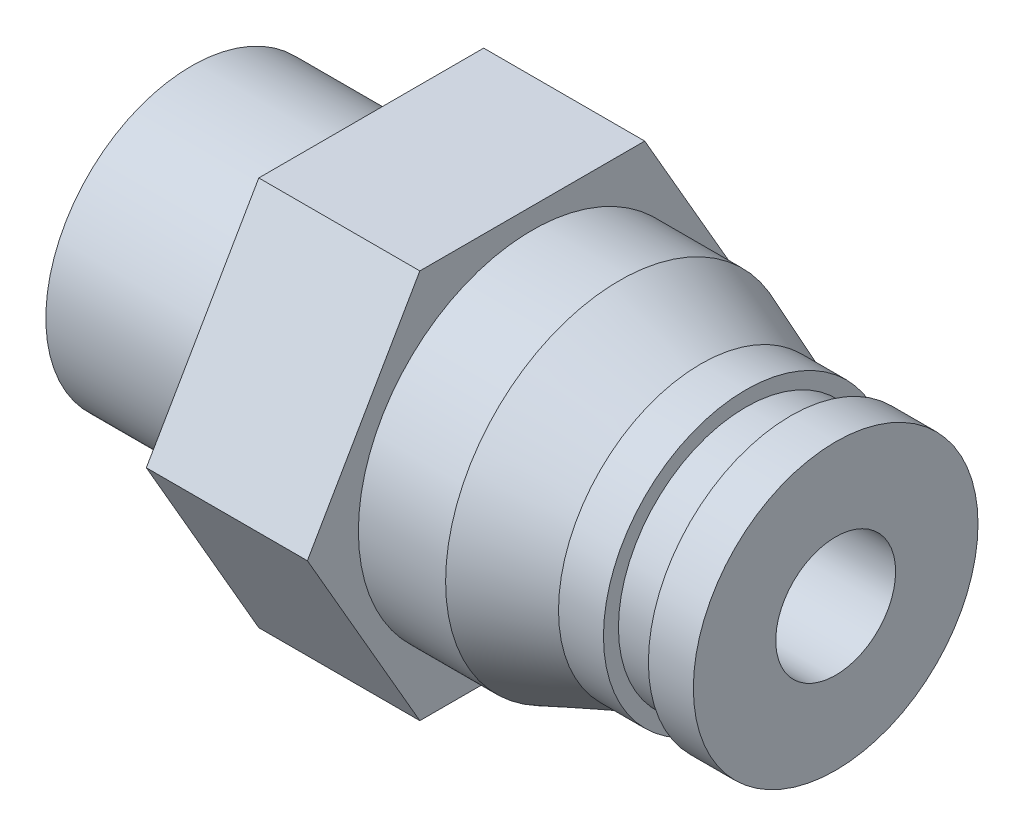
ISO-10303-21;
HEADER;
FILE_DESCRIPTION(('STEP AP214'),'2;1');
FILE_NAME('part.step','',(''),(''),'','','');
FILE_SCHEMA(('AUTOMOTIVE_DESIGN { 1 0 10303 214 1 1 1 1 }'));
ENDSEC;
DATA;
#1=APPLICATION_CONTEXT('core data for automotive mechanical design processes');
#2=APPLICATION_PROTOCOL_DEFINITION('international standard','automotive_design',2000,#1);
#3=PRODUCT_CONTEXT('',#1,'mechanical');
#4=PRODUCT('Part','Part','',(#3));
#5=PRODUCT_RELATED_PRODUCT_CATEGORY('part','',(#4));
#6=PRODUCT_DEFINITION_FORMATION('','',#4);
#7=PRODUCT_DEFINITION_CONTEXT('part definition',#1,'design');
#8=PRODUCT_DEFINITION('design','',#6,#7);
#9=PRODUCT_DEFINITION_SHAPE('','',#8);
#10=(LENGTH_UNIT() NAMED_UNIT(*) SI_UNIT(.MILLI.,.METRE.));
#11=(NAMED_UNIT(*) PLANE_ANGLE_UNIT() SI_UNIT($,.RADIAN.));
#12=(NAMED_UNIT(*) SI_UNIT($,.STERADIAN.) SOLID_ANGLE_UNIT());
#13=UNCERTAINTY_MEASURE_WITH_UNIT(LENGTH_MEASURE(1.E-05),#10,'distance_accuracy_value','');
#14=(GEOMETRIC_REPRESENTATION_CONTEXT(3) GLOBAL_UNCERTAINTY_ASSIGNED_CONTEXT((#13)) GLOBAL_UNIT_ASSIGNED_CONTEXT((#10,
#11,#12)) REPRESENTATION_CONTEXT('',''));
#15=CARTESIAN_POINT('',(0.,0.,0.));
#16=DIRECTION('',(0.,0.,1.));
#17=DIRECTION('',(1.,0.,0.));
#18=AXIS2_PLACEMENT_3D('',#15,#16,#17);
#19=CARTESIAN_POINT('',(6.,4.86,0.));
#20=DIRECTION('',(-1.,0.,0.));
#21=DIRECTION('',(0.,0.,1.));
#22=AXIS2_PLACEMENT_3D('',#19,#20,#21);
#23=PLANE('',#22);
#24=CARTESIAN_POINT('',(6.,0.,0.));
#25=DIRECTION('',(1.,0.,0.));
#26=DIRECTION('',(0.,0.,-1.));
#27=AXIS2_PLACEMENT_3D('',#24,#25,#26);
#28=CIRCLE('',#27,4.86);
#29=CARTESIAN_POINT('',(6.,0.,-4.86));
#30=VERTEX_POINT('',#29);
#31=EDGE_CURVE('E214',#30,#30,#28,.T.);
#32=ORIENTED_EDGE('',*,*,#31,.T.);
#33=EDGE_LOOP('',(#32));
#34=FACE_BOUND('',#33,.T.);
#35=DIRECTION('',(0.,-0.866025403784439,0.5));
#36=VECTOR('',#35,1.);
#37=CARTESIAN_POINT('',(6.,0.,-7.50555349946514));
#38=LINE('',#37,#36);
#39=CARTESIAN_POINT('',(6.,0.,-7.50555349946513));
#40=VERTEX_POINT('',#39);
#41=CARTESIAN_POINT('',(6.,-6.5,-3.75277674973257));
#42=VERTEX_POINT('',#41);
#43=EDGE_CURVE('E120',#40,#42,#38,.T.);
#44=ORIENTED_EDGE('',*,*,#43,.T.);
#45=DIRECTION('',(0.,0.,1.));
#46=VECTOR('',#45,1.);
#47=CARTESIAN_POINT('',(6.,-6.5,-3.75277674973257));
#48=LINE('',#47,#46);
#49=CARTESIAN_POINT('',(6.,-6.5,3.75277674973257));
#50=VERTEX_POINT('',#49);
#51=EDGE_CURVE('E105',#42,#50,#48,.T.);
#52=ORIENTED_EDGE('',*,*,#51,.T.);
#53=DIRECTION('',(0.,0.866025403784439,0.5));
#54=VECTOR('',#53,1.);
#55=CARTESIAN_POINT('',(6.,-6.5,3.75277674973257));
#56=LINE('',#55,#54);
#57=CARTESIAN_POINT('',(6.,0.,7.50555349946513));
#58=VERTEX_POINT('',#57);
#59=EDGE_CURVE('E114',#50,#58,#56,.T.);
#60=ORIENTED_EDGE('',*,*,#59,.T.);
#61=DIRECTION('',(0.,0.866025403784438,-0.5));
#62=VECTOR('',#61,1.);
#63=CARTESIAN_POINT('',(6.,0.,7.50555349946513));
#64=LINE('',#63,#62);
#65=CARTESIAN_POINT('',(6.,6.5,3.75277674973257));
#66=VERTEX_POINT('',#65);
#67=EDGE_CURVE('E29',#58,#66,#64,.T.);
#68=ORIENTED_EDGE('',*,*,#67,.T.);
#69=DIRECTION('',(0.,0.,-1.));
#70=VECTOR('',#69,1.);
#71=CARTESIAN_POINT('',(6.,6.5,3.75277674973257));
#72=LINE('',#71,#70);
#73=CARTESIAN_POINT('',(6.,6.5,-3.75277674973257));
#74=VERTEX_POINT('',#73);
#75=EDGE_CURVE('E124',#66,#74,#72,.T.);
#76=ORIENTED_EDGE('',*,*,#75,.T.);
#77=DIRECTION('',(0.,-0.866025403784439,-0.5));
#78=VECTOR('',#77,1.);
#79=CARTESIAN_POINT('',(6.,6.5,-3.75277674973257));
#80=LINE('',#79,#78);
#81=EDGE_CURVE('E127',#74,#40,#80,.T.);
#82=ORIENTED_EDGE('',*,*,#81,.T.);
#83=EDGE_LOOP('',(#44,#52,#60,#68,#76,#82));
#84=FACE_BOUND('',#83,.T.);
#85=ADVANCED_FACE('F14',(#34,#84),#23,.T.);
#86=CARTESIAN_POINT('',(11.375,8.5,0.));
#87=DIRECTION('',(1.,0.,0.));
#88=DIRECTION('',(0.,0.,-1.));
#89=AXIS2_PLACEMENT_3D('',#86,#87,#88);
#90=PLANE('',#89);
#91=CARTESIAN_POINT('',(11.375,0.,0.));
#92=DIRECTION('',(1.,0.,0.));
#93=DIRECTION('',(0.,0.,-1.));
#94=AXIS2_PLACEMENT_3D('',#91,#92,#93);
#95=CIRCLE('',#94,5.80412866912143);
#96=CARTESIAN_POINT('',(11.375,0.,-5.80412866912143));
#97=VERTEX_POINT('',#96);
#98=EDGE_CURVE('E211',#97,#97,#95,.T.);
#99=ORIENTED_EDGE('',*,*,#98,.F.);
#100=EDGE_LOOP('',(#99));
#101=FACE_BOUND('',#100,.T.);
#102=DIRECTION('',(0.,0.866025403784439,0.5));
#103=VECTOR('',#102,1.);
#104=CARTESIAN_POINT('',(11.375,-6.5,3.75277674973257));
#105=LINE('',#104,#103);
#106=CARTESIAN_POINT('',(11.375,-6.5,3.75277674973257));
#107=VERTEX_POINT('',#106);
#108=CARTESIAN_POINT('',(11.375,0.,7.50555349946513));
#109=VERTEX_POINT('',#108);
#110=EDGE_CURVE('E131',#107,#109,#105,.T.);
#111=ORIENTED_EDGE('',*,*,#110,.F.);
#112=DIRECTION('',(0.,0.,1.));
#113=VECTOR('',#112,1.);
#114=CARTESIAN_POINT('',(11.375,-6.5,-3.75277674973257));
#115=LINE('',#114,#113);
#116=CARTESIAN_POINT('',(11.375,-6.5,-3.75277674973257));
#117=VERTEX_POINT('',#116);
#118=EDGE_CURVE('E37',#117,#107,#115,.T.);
#119=ORIENTED_EDGE('',*,*,#118,.F.);
#120=DIRECTION('',(0.,-0.866025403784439,0.5));
#121=VECTOR('',#120,1.);
#122=CARTESIAN_POINT('',(11.375,0.,-7.50555349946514));
#123=LINE('',#122,#121);
#124=CARTESIAN_POINT('',(11.375,0.,-7.50555349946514));
#125=VERTEX_POINT('',#124);
#126=EDGE_CURVE('E111',#125,#117,#123,.T.);
#127=ORIENTED_EDGE('',*,*,#126,.F.);
#128=DIRECTION('',(0.,-0.866025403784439,-0.5));
#129=VECTOR('',#128,1.);
#130=CARTESIAN_POINT('',(11.375,6.5,-3.75277674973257));
#131=LINE('',#130,#129);
#132=CARTESIAN_POINT('',(11.375,6.5,-3.75277674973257));
#133=VERTEX_POINT('',#132);
#134=EDGE_CURVE('E139',#133,#125,#131,.T.);
#135=ORIENTED_EDGE('',*,*,#134,.F.);
#136=DIRECTION('',(0.,0.,-1.));
#137=VECTOR('',#136,1.);
#138=CARTESIAN_POINT('',(11.375,6.5,3.75277674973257));
#139=LINE('',#138,#137);
#140=CARTESIAN_POINT('',(11.375,6.5,3.75277674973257));
#141=VERTEX_POINT('',#140);
#142=EDGE_CURVE('E136',#141,#133,#139,.T.);
#143=ORIENTED_EDGE('',*,*,#142,.F.);
#144=DIRECTION('',(0.,0.866025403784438,-0.5));
#145=VECTOR('',#144,1.);
#146=CARTESIAN_POINT('',(11.375,0.,7.50555349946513));
#147=LINE('',#146,#145);
#148=EDGE_CURVE('E133',#109,#141,#147,.T.);
#149=ORIENTED_EDGE('',*,*,#148,.F.);
#150=EDGE_LOOP('',(#111,#119,#127,#135,#143,#149));
#151=FACE_BOUND('',#150,.T.);
#152=ADVANCED_FACE('F268',(#101,#151),#90,.T.);
#153=CARTESIAN_POINT('',(0.,0.,0.));
#154=DIRECTION('',(-1.,0.,0.));
#155=DIRECTION('',(0.,0.,1.));
#156=AXIS2_PLACEMENT_3D('',#153,#154,#155);
#157=PLANE('',#156);
#158=CARTESIAN_POINT('',(0.,0.,0.));
#159=DIRECTION('',(1.,0.,0.));
#160=DIRECTION('',(0.,0.,-1.));
#161=AXIS2_PLACEMENT_3D('',#158,#159,#160);
#162=CIRCLE('',#161,4.86);
#163=CARTESIAN_POINT('',(0.,0.,-4.86));
#164=VERTEX_POINT('',#163);
#165=EDGE_CURVE('E217',#164,#164,#162,.T.);
#166=ORIENTED_EDGE('',*,*,#165,.F.);
#167=EDGE_LOOP('',(#166));
#168=FACE_BOUND('',#167,.T.);
#169=DIRECTION('',(0.,-0.866025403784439,-0.5));
#170=VECTOR('',#169,1.);
#171=CARTESIAN_POINT('',(0.,0.,1.73205080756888));
#172=LINE('',#171,#170);
#173=CARTESIAN_POINT('',(0.,0.,1.73205080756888));
#174=VERTEX_POINT('',#173);
#175=CARTESIAN_POINT('',(0.,-1.5,0.866025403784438));
#176=VERTEX_POINT('',#175);
#177=EDGE_CURVE('E168',#174,#176,#172,.T.);
#178=ORIENTED_EDGE('',*,*,#177,.T.);
#179=DIRECTION('',(0.,0.,-1.));
#180=VECTOR('',#179,1.);
#181=CARTESIAN_POINT('',(0.,-1.5,0.866025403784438));
#182=LINE('',#181,#180);
#183=CARTESIAN_POINT('',(0.,-1.5,-0.866025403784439));
#184=VERTEX_POINT('',#183);
#185=EDGE_CURVE('E146',#176,#184,#182,.T.);
#186=ORIENTED_EDGE('',*,*,#185,.T.);
#187=DIRECTION('',(0.,0.866025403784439,-0.5));
#188=VECTOR('',#187,1.);
#189=CARTESIAN_POINT('',(0.,-1.5,-0.866025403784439));
#190=LINE('',#189,#188);
#191=CARTESIAN_POINT('',(0.,0.,-1.73205080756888));
#192=VERTEX_POINT('',#191);
#193=EDGE_CURVE('E156',#184,#192,#190,.T.);
#194=ORIENTED_EDGE('',*,*,#193,.T.);
#195=DIRECTION('',(0.,0.866025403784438,0.5));
#196=VECTOR('',#195,1.);
#197=CARTESIAN_POINT('',(0.,0.,-1.73205080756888));
#198=LINE('',#197,#196);
#199=CARTESIAN_POINT('',(0.,1.5,-0.866025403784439));
#200=VERTEX_POINT('',#199);
#201=EDGE_CURVE('E159',#192,#200,#198,.T.);
#202=ORIENTED_EDGE('',*,*,#201,.T.);
#203=DIRECTION('',(0.,0.,1.));
#204=VECTOR('',#203,1.);
#205=CARTESIAN_POINT('',(0.,1.5,-0.866025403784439));
#206=LINE('',#205,#204);
#207=CARTESIAN_POINT('',(0.,1.5,0.866025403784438));
#208=VERTEX_POINT('',#207);
#209=EDGE_CURVE('E162',#200,#208,#206,.T.);
#210=ORIENTED_EDGE('',*,*,#209,.T.);
#211=DIRECTION('',(0.,-0.866025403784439,0.5));
#212=VECTOR('',#211,1.);
#213=CARTESIAN_POINT('',(0.,1.5,0.866025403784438));
#214=LINE('',#213,#212);
#215=EDGE_CURVE('E165',#208,#174,#214,.T.);
#216=ORIENTED_EDGE('',*,*,#215,.T.);
#217=EDGE_LOOP('',(#178,#186,#194,#202,#210,#216));
#218=FACE_BOUND('',#217,.T.);
#219=ADVANCED_FACE('F16',(#168,#218),#157,.T.);
#220=CARTESIAN_POINT('',(5.5,2.,0.));
#221=DIRECTION('',(1.,0.,0.));
#222=DIRECTION('',(0.,0.,-1.));
#223=AXIS2_PLACEMENT_3D('',#220,#221,#222);
#224=PLANE('',#223);
#225=CARTESIAN_POINT('',(5.5,0.,0.));
#226=DIRECTION('',(1.,0.,0.));
#227=DIRECTION('',(0.,0.,-1.));
#228=AXIS2_PLACEMENT_3D('',#225,#226,#227);
#229=CIRCLE('',#228,2.);
#230=CARTESIAN_POINT('',(5.5,0.,-2.));
#231=VERTEX_POINT('',#230);
#232=EDGE_CURVE('E184',#231,#231,#229,.T.);
#233=ORIENTED_EDGE('',*,*,#232,.T.);
#234=EDGE_LOOP('',(#233));
#235=FACE_BOUND('',#234,.T.);
#236=DIRECTION('',(0.,-0.866025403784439,0.5));
#237=VECTOR('',#236,1.);
#238=CARTESIAN_POINT('',(5.5,0.75,-2.1650635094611));
#239=LINE('',#238,#237);
#240=CARTESIAN_POINT('',(5.5,0.,-1.73205080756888));
#241=VERTEX_POINT('',#240);
#242=CARTESIAN_POINT('',(5.5,-1.5,-0.866025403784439));
#243=VERTEX_POINT('',#242);
#244=EDGE_CURVE('E22',#241,#243,#239,.T.);
#245=ORIENTED_EDGE('',*,*,#244,.T.);
#246=DIRECTION('',(0.,0.,1.));
#247=VECTOR('',#246,1.);
#248=CARTESIAN_POINT('',(5.5,-1.5,0.));
#249=LINE('',#248,#247);
#250=CARTESIAN_POINT('',(5.5,-1.5,0.866025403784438));
#251=VERTEX_POINT('',#250);
#252=EDGE_CURVE('E9',#243,#251,#249,.T.);
#253=ORIENTED_EDGE('',*,*,#252,.T.);
#254=DIRECTION('',(0.,0.866025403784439,0.5));
#255=VECTOR('',#254,1.);
#256=CARTESIAN_POINT('',(5.5,0.75,2.1650635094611));
#257=LINE('',#256,#255);
#258=CARTESIAN_POINT('',(5.5,0.,1.73205080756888));
#259=VERTEX_POINT('',#258);
#260=EDGE_CURVE('E220',#251,#259,#257,.T.);
#261=ORIENTED_EDGE('',*,*,#260,.T.);
#262=DIRECTION('',(0.,0.866025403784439,-0.5));
#263=VECTOR('',#262,1.);
#264=CARTESIAN_POINT('',(5.5,2.25,0.433012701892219));
#265=LINE('',#264,#263);
#266=CARTESIAN_POINT('',(5.5,1.5,0.866025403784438));
#267=VERTEX_POINT('',#266);
#268=EDGE_CURVE('E223',#259,#267,#265,.T.);
#269=ORIENTED_EDGE('',*,*,#268,.T.);
#270=DIRECTION('',(0.,0.,-1.));
#271=VECTOR('',#270,1.);
#272=CARTESIAN_POINT('',(5.5,1.5,0.));
#273=LINE('',#272,#271);
#274=CARTESIAN_POINT('',(5.5,1.5,-0.866025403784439));
#275=VERTEX_POINT('',#274);
#276=EDGE_CURVE('E226',#267,#275,#273,.T.);
#277=ORIENTED_EDGE('',*,*,#276,.T.);
#278=DIRECTION('',(0.,-0.866025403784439,-0.5));
#279=VECTOR('',#278,1.);
#280=CARTESIAN_POINT('',(5.5,2.25,-0.433012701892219));
#281=LINE('',#280,#279);
#282=EDGE_CURVE('E229',#275,#241,#281,.T.);
#283=ORIENTED_EDGE('',*,*,#282,.T.);
#284=EDGE_LOOP('',(#245,#253,#261,#269,#277,#283));
#285=FACE_BOUND('',#284,.T.);
#286=ADVANCED_FACE('F233',(#235,#285),#224,.T.);
#287=CARTESIAN_POINT('',(0.,0.,0.));
#288=DIRECTION('',(1.,0.,0.));
#289=DIRECTION('',(0.,0.,-1.));
#290=AXIS2_PLACEMENT_3D('',#287,#288,#289);
#291=CYLINDRICAL_SURFACE('',#290,4.86);
#292=ORIENTED_EDGE('',*,*,#165,.T.);
#293=EDGE_LOOP('',(#292));
#294=FACE_BOUND('',#293,.T.);
#295=ORIENTED_EDGE('',*,*,#31,.F.);
#296=EDGE_LOOP('',(#295));
#297=FACE_BOUND('',#296,.T.);
#298=ADVANCED_FACE('F277',(#294,#297),#291,.T.);
#299=CARTESIAN_POINT('',(0.,0.,0.));
#300=DIRECTION('',(1.,0.,0.));
#301=DIRECTION('',(0.,0.,-1.));
#302=AXIS2_PLACEMENT_3D('',#299,#300,#301);
#303=CYLINDRICAL_SURFACE('',#302,5.80412866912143);
#304=ORIENTED_EDGE('',*,*,#98,.T.);
#305=EDGE_LOOP('',(#304));
#306=FACE_BOUND('',#305,.T.);
#307=CARTESIAN_POINT('',(14.2862722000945,0.,0.));
#308=DIRECTION('',(1.,0.,0.));
#309=DIRECTION('',(0.,0.,-1.));
#310=AXIS2_PLACEMENT_3D('',#307,#308,#309);
#311=CIRCLE('',#310,5.80412866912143);
#312=CARTESIAN_POINT('',(14.2862722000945,0.,-5.80412866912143));
#313=VERTEX_POINT('',#312);
#314=EDGE_CURVE('E208',#313,#313,#311,.T.);
#315=ORIENTED_EDGE('',*,*,#314,.F.);
#316=EDGE_LOOP('',(#315));
#317=FACE_BOUND('',#316,.T.);
#318=ADVANCED_FACE('F279',(#306,#317),#303,.T.);
#319=CARTESIAN_POINT('',(17.,0.,0.));
#320=DIRECTION('',(-1.,0.,0.));
#321=DIRECTION('',(0.,0.,1.));
#322=AXIS2_PLACEMENT_3D('',#319,#320,#321);
#323=CONICAL_SURFACE('',#322,4.75,0.370503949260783);
#324=ORIENTED_EDGE('',*,*,#314,.T.);
#325=EDGE_LOOP('',(#324));
#326=FACE_BOUND('',#325,.T.);
#327=CARTESIAN_POINT('',(17.,0.,0.));
#328=DIRECTION('',(1.,0.,0.));
#329=DIRECTION('',(0.,0.,-1.));
#330=AXIS2_PLACEMENT_3D('',#327,#328,#329);
#331=CIRCLE('',#330,4.75);
#332=CARTESIAN_POINT('',(17.,0.,-4.75));
#333=VERTEX_POINT('',#332);
#334=EDGE_CURVE('E205',#333,#333,#331,.T.);
#335=ORIENTED_EDGE('',*,*,#334,.F.);
#336=EDGE_LOOP('',(#335));
#337=FACE_BOUND('',#336,.T.);
#338=ADVANCED_FACE('F285',(#326,#337),#323,.T.);
#339=CARTESIAN_POINT('',(0.,0.,0.));
#340=DIRECTION('',(1.,0.,0.));
#341=DIRECTION('',(0.,0.,-1.));
#342=AXIS2_PLACEMENT_3D('',#339,#340,#341);
#343=CYLINDRICAL_SURFACE('',#342,4.75);
#344=ORIENTED_EDGE('',*,*,#334,.T.);
#345=EDGE_LOOP('',(#344));
#346=FACE_BOUND('',#345,.T.);
#347=CARTESIAN_POINT('',(18.5,0.,0.));
#348=DIRECTION('',(1.,0.,0.));
#349=DIRECTION('',(0.,0.,-1.));
#350=AXIS2_PLACEMENT_3D('',#347,#348,#349);
#351=CIRCLE('',#350,4.75);
#352=CARTESIAN_POINT('',(18.5,0.,-4.75));
#353=VERTEX_POINT('',#352);
#354=EDGE_CURVE('E202',#353,#353,#351,.T.);
#355=ORIENTED_EDGE('',*,*,#354,.F.);
#356=EDGE_LOOP('',(#355));
#357=FACE_BOUND('',#356,.T.);
#358=ADVANCED_FACE('F329',(#346,#357),#343,.T.);
#359=CARTESIAN_POINT('',(18.5,4.75,0.));
#360=DIRECTION('',(1.,0.,0.));
#361=DIRECTION('',(0.,0.,-1.));
#362=AXIS2_PLACEMENT_3D('',#359,#360,#361);
#363=PLANE('',#362);
#364=ORIENTED_EDGE('',*,*,#354,.T.);
#365=EDGE_LOOP('',(#364));
#366=FACE_BOUND('',#365,.T.);
#367=CARTESIAN_POINT('',(18.5,0.,0.));
#368=DIRECTION('',(1.,0.,0.));
#369=DIRECTION('',(0.,0.,-1.));
#370=AXIS2_PLACEMENT_3D('',#367,#368,#369);
#371=CIRCLE('',#370,4.25);
#372=CARTESIAN_POINT('',(18.5,0.,-4.25));
#373=VERTEX_POINT('',#372);
#374=EDGE_CURVE('E199',#373,#373,#371,.T.);
#375=ORIENTED_EDGE('',*,*,#374,.F.);
#376=EDGE_LOOP('',(#375));
#377=FACE_BOUND('',#376,.T.);
#378=ADVANCED_FACE('F339',(#366,#377),#363,.T.);
#379=CARTESIAN_POINT('',(0.,0.,0.));
#380=DIRECTION('',(1.,0.,0.));
#381=DIRECTION('',(0.,0.,-1.));
#382=AXIS2_PLACEMENT_3D('',#379,#380,#381);
#383=CYLINDRICAL_SURFACE('',#382,4.25);
#384=ORIENTED_EDGE('',*,*,#374,.T.);
#385=EDGE_LOOP('',(#384));
#386=FACE_BOUND('',#385,.T.);
#387=CARTESIAN_POINT('',(20.,0.,0.));
#388=DIRECTION('',(1.,0.,0.));
#389=DIRECTION('',(0.,0.,-1.));
#390=AXIS2_PLACEMENT_3D('',#387,#388,#389);
#391=CIRCLE('',#390,4.25);
#392=CARTESIAN_POINT('',(20.,0.,-4.25));
#393=VERTEX_POINT('',#392);
#394=EDGE_CURVE('E196',#393,#393,#391,.T.);
#395=ORIENTED_EDGE('',*,*,#394,.F.);
#396=EDGE_LOOP('',(#395));
#397=FACE_BOUND('',#396,.T.);
#398=ADVANCED_FACE('F349',(#386,#397),#383,.T.);
#399=CARTESIAN_POINT('',(20.,4.25,0.));
#400=DIRECTION('',(-1.,0.,0.));
#401=DIRECTION('',(0.,0.,1.));
#402=AXIS2_PLACEMENT_3D('',#399,#400,#401);
#403=PLANE('',#402);
#404=ORIENTED_EDGE('',*,*,#394,.T.);
#405=EDGE_LOOP('',(#404));
#406=FACE_BOUND('',#405,.T.);
#407=CARTESIAN_POINT('',(20.,0.,0.));
#408=DIRECTION('',(1.,0.,0.));
#409=DIRECTION('',(0.,0.,-1.));
#410=AXIS2_PLACEMENT_3D('',#407,#408,#409);
#411=CIRCLE('',#410,4.75);
#412=CARTESIAN_POINT('',(20.,0.,-4.75));
#413=VERTEX_POINT('',#412);
#414=EDGE_CURVE('E193',#413,#413,#411,.T.);
#415=ORIENTED_EDGE('',*,*,#414,.F.);
#416=EDGE_LOOP('',(#415));
#417=FACE_BOUND('',#416,.T.);
#418=ADVANCED_FACE('F360',(#406,#417),#403,.T.);
#419=CARTESIAN_POINT('',(0.,0.,0.));
#420=DIRECTION('',(1.,0.,0.));
#421=DIRECTION('',(0.,0.,-1.));
#422=AXIS2_PLACEMENT_3D('',#419,#420,#421);
#423=CYLINDRICAL_SURFACE('',#422,4.75);
#424=ORIENTED_EDGE('',*,*,#414,.T.);
#425=EDGE_LOOP('',(#424));
#426=FACE_BOUND('',#425,.T.);
#427=CARTESIAN_POINT('',(21.5,0.,0.));
#428=DIRECTION('',(1.,0.,0.));
#429=DIRECTION('',(0.,0.,-1.));
#430=AXIS2_PLACEMENT_3D('',#427,#428,#429);
#431=CIRCLE('',#430,4.75);
#432=CARTESIAN_POINT('',(21.5,0.,-4.75));
#433=VERTEX_POINT('',#432);
#434=EDGE_CURVE('E190',#433,#433,#431,.T.);
#435=ORIENTED_EDGE('',*,*,#434,.F.);
#436=EDGE_LOOP('',(#435));
#437=FACE_BOUND('',#436,.T.);
#438=ADVANCED_FACE('F372',(#426,#437),#423,.T.);
#439=CARTESIAN_POINT('',(21.5,4.75,0.));
#440=DIRECTION('',(1.,0.,0.));
#441=DIRECTION('',(0.,0.,-1.));
#442=AXIS2_PLACEMENT_3D('',#439,#440,#441);
#443=PLANE('',#442);
#444=ORIENTED_EDGE('',*,*,#434,.T.);
#445=EDGE_LOOP('',(#444));
#446=FACE_BOUND('',#445,.T.);
#447=CARTESIAN_POINT('',(21.5,0.,0.));
#448=DIRECTION('',(1.,0.,0.));
#449=DIRECTION('',(0.,0.,-1.));
#450=AXIS2_PLACEMENT_3D('',#447,#448,#449);
#451=CIRCLE('',#450,2.);
#452=CARTESIAN_POINT('',(21.5,0.,-2.));
#453=VERTEX_POINT('',#452);
#454=EDGE_CURVE('E187',#453,#453,#451,.T.);
#455=ORIENTED_EDGE('',*,*,#454,.F.);
#456=EDGE_LOOP('',(#455));
#457=FACE_BOUND('',#456,.T.);
#458=ADVANCED_FACE('F384',(#446,#457),#443,.T.);
#459=CARTESIAN_POINT('',(0.,0.,0.));
#460=DIRECTION('',(1.,0.,0.));
#461=DIRECTION('',(0.,0.,-1.));
#462=AXIS2_PLACEMENT_3D('',#459,#460,#461);
#463=CYLINDRICAL_SURFACE('',#462,2.);
#464=ORIENTED_EDGE('',*,*,#454,.T.);
#465=EDGE_LOOP('',(#464));
#466=FACE_BOUND('',#465,.T.);
#467=ORIENTED_EDGE('',*,*,#232,.F.);
#468=EDGE_LOOP('',(#467));
#469=FACE_BOUND('',#468,.T.);
#470=ADVANCED_FACE('F395',(#466,#469),#463,.F.);
#471=CARTESIAN_POINT('',(21.5,-1.5,0.866025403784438));
#472=DIRECTION('',(0.,1.,0.));
#473=DIRECTION('',(0.,0.,1.));
#474=AXIS2_PLACEMENT_3D('',#471,#472,#473);
#475=PLANE('',#474);
#476=DIRECTION('',(-1.,0.,0.));
#477=VECTOR('',#476,1.);
#478=CARTESIAN_POINT('',(21.5,-1.5,-0.866025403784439));
#479=LINE('',#478,#477);
#480=EDGE_CURVE('E182',#243,#184,#479,.T.);
#481=ORIENTED_EDGE('',*,*,#480,.T.);
#482=ORIENTED_EDGE('',*,*,#185,.F.);
#483=DIRECTION('',(-1.,0.,0.));
#484=VECTOR('',#483,1.);
#485=CARTESIAN_POINT('',(21.5,-1.5,0.866025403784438));
#486=LINE('',#485,#484);
#487=EDGE_CURVE('E171',#251,#176,#486,.T.);
#488=ORIENTED_EDGE('',*,*,#487,.F.);
#489=ORIENTED_EDGE('',*,*,#252,.F.);
#490=EDGE_LOOP('',(#481,#482,#488,#489));
#491=FACE_BOUND('',#490,.T.);
#492=ADVANCED_FACE('F248',(#491),#475,.T.);
#493=CARTESIAN_POINT('',(21.5,-1.5,-0.866025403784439));
#494=DIRECTION('',(0.,0.5,0.866025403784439));
#495=DIRECTION('',(0.,-0.866025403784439,0.5));
#496=AXIS2_PLACEMENT_3D('',#493,#494,#495);
#497=PLANE('',#496);
#498=DIRECTION('',(-1.,0.,0.));
#499=VECTOR('',#498,1.);
#500=CARTESIAN_POINT('',(21.5,0.,-1.73205080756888));
#501=LINE('',#500,#499);
#502=EDGE_CURVE('E180',#241,#192,#501,.T.);
#503=ORIENTED_EDGE('',*,*,#502,.T.);
#504=ORIENTED_EDGE('',*,*,#193,.F.);
#505=ORIENTED_EDGE('',*,*,#480,.F.);
#506=ORIENTED_EDGE('',*,*,#244,.F.);
#507=EDGE_LOOP('',(#503,#504,#505,#506));
#508=FACE_BOUND('',#507,.T.);
#509=ADVANCED_FACE('F237',(#508),#497,.T.);
#510=CARTESIAN_POINT('',(21.5,0.,-1.73205080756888));
#511=DIRECTION('',(0.,-0.5,0.866025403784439));
#512=DIRECTION('',(0.,-0.866025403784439,-0.5));
#513=AXIS2_PLACEMENT_3D('',#510,#511,#512);
#514=PLANE('',#513);
#515=DIRECTION('',(-1.,0.,0.));
#516=VECTOR('',#515,1.);
#517=CARTESIAN_POINT('',(21.5,1.5,-0.866025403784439));
#518=LINE('',#517,#516);
#519=EDGE_CURVE('E178',#275,#200,#518,.T.);
#520=ORIENTED_EDGE('',*,*,#519,.T.);
#521=ORIENTED_EDGE('',*,*,#201,.F.);
#522=ORIENTED_EDGE('',*,*,#502,.F.);
#523=ORIENTED_EDGE('',*,*,#282,.F.);
#524=EDGE_LOOP('',(#520,#521,#522,#523));
#525=FACE_BOUND('',#524,.T.);
#526=ADVANCED_FACE('F241',(#525),#514,.T.);
#527=CARTESIAN_POINT('',(21.5,1.5,-0.866025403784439));
#528=DIRECTION('',(0.,-1.,0.));
#529=DIRECTION('',(0.,0.,-1.));
#530=AXIS2_PLACEMENT_3D('',#527,#528,#529);
#531=PLANE('',#530);
#532=DIRECTION('',(-1.,0.,0.));
#533=VECTOR('',#532,1.);
#534=CARTESIAN_POINT('',(21.5,1.5,0.866025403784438));
#535=LINE('',#534,#533);
#536=EDGE_CURVE('E176',#267,#208,#535,.T.);
#537=ORIENTED_EDGE('',*,*,#536,.T.);
#538=ORIENTED_EDGE('',*,*,#209,.F.);
#539=ORIENTED_EDGE('',*,*,#519,.F.);
#540=ORIENTED_EDGE('',*,*,#276,.F.);
#541=EDGE_LOOP('',(#537,#538,#539,#540));
#542=FACE_BOUND('',#541,.T.);
#543=ADVANCED_FACE('F257',(#542),#531,.T.);
#544=CARTESIAN_POINT('',(21.5,1.5,0.866025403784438));
#545=DIRECTION('',(0.,-0.5,-0.866025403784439));
#546=DIRECTION('',(0.,0.866025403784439,-0.5));
#547=AXIS2_PLACEMENT_3D('',#544,#545,#546);
#548=PLANE('',#547);
#549=DIRECTION('',(-1.,0.,0.));
#550=VECTOR('',#549,1.);
#551=CARTESIAN_POINT('',(21.5,0.,1.73205080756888));
#552=LINE('',#551,#550);
#553=EDGE_CURVE('E174',#259,#174,#552,.T.);
#554=ORIENTED_EDGE('',*,*,#553,.T.);
#555=ORIENTED_EDGE('',*,*,#215,.F.);
#556=ORIENTED_EDGE('',*,*,#536,.F.);
#557=ORIENTED_EDGE('',*,*,#268,.F.);
#558=EDGE_LOOP('',(#554,#555,#556,#557));
#559=FACE_BOUND('',#558,.T.);
#560=ADVANCED_FACE('F254',(#559),#548,.T.);
#561=CARTESIAN_POINT('',(21.5,0.,1.73205080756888));
#562=DIRECTION('',(0.,0.5,-0.866025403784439));
#563=DIRECTION('',(0.,0.866025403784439,0.5));
#564=AXIS2_PLACEMENT_3D('',#561,#562,#563);
#565=PLANE('',#564);
#566=ORIENTED_EDGE('',*,*,#487,.T.);
#567=ORIENTED_EDGE('',*,*,#177,.F.);
#568=ORIENTED_EDGE('',*,*,#553,.F.);
#569=ORIENTED_EDGE('',*,*,#260,.F.);
#570=EDGE_LOOP('',(#566,#567,#568,#569));
#571=FACE_BOUND('',#570,.T.);
#572=ADVANCED_FACE('F250',(#571),#565,.T.);
#573=CARTESIAN_POINT('',(11.375,-6.5,-3.75277674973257));
#574=DIRECTION('',(0.,-1.,0.));
#575=DIRECTION('',(0.,0.,-1.));
#576=AXIS2_PLACEMENT_3D('',#573,#574,#575);
#577=PLANE('',#576);
#578=DIRECTION('',(-1.,0.,0.));
#579=VECTOR('',#578,1.);
#580=CARTESIAN_POINT('',(11.375,-6.5,-3.75277674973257));
#581=LINE('',#580,#579);
#582=EDGE_CURVE('E144',#117,#42,#581,.T.);
#583=ORIENTED_EDGE('',*,*,#582,.F.);
#584=ORIENTED_EDGE('',*,*,#118,.T.);
#585=DIRECTION('',(-1.,0.,0.));
#586=VECTOR('',#585,1.);
#587=CARTESIAN_POINT('',(11.375,-6.5,3.75277674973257));
#588=LINE('',#587,#586);
#589=EDGE_CURVE('E101',#107,#50,#588,.T.);
#590=ORIENTED_EDGE('',*,*,#589,.T.);
#591=ORIENTED_EDGE('',*,*,#51,.F.);
#592=EDGE_LOOP('',(#583,#584,#590,#591));
#593=FACE_BOUND('',#592,.T.);
#594=ADVANCED_FACE('F103',(#593),#577,.T.);
#595=CARTESIAN_POINT('',(11.375,0.,-7.50555349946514));
#596=DIRECTION('',(0.,-0.5,-0.866025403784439));
#597=DIRECTION('',(0.,0.866025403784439,-0.5));
#598=AXIS2_PLACEMENT_3D('',#595,#596,#597);
#599=PLANE('',#598);
#600=DIRECTION('',(-1.,0.,0.));
#601=VECTOR('',#600,1.);
#602=CARTESIAN_POINT('',(11.375,0.,-7.50555349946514));
#603=LINE('',#602,#601);
#604=EDGE_CURVE('E147',#125,#40,#603,.T.);
#605=ORIENTED_EDGE('',*,*,#604,.F.);
#606=ORIENTED_EDGE('',*,*,#126,.T.);
#607=ORIENTED_EDGE('',*,*,#582,.T.);
#608=ORIENTED_EDGE('',*,*,#43,.F.);
#609=EDGE_LOOP('',(#605,#606,#607,#608));
#610=FACE_BOUND('',#609,.T.);
#611=ADVANCED_FACE('F456',(#610),#599,.T.);
#612=CARTESIAN_POINT('',(11.375,6.5,-3.75277674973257));
#613=DIRECTION('',(0.,0.5,-0.866025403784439));
#614=DIRECTION('',(0.,0.866025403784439,0.5));
#615=AXIS2_PLACEMENT_3D('',#612,#613,#614);
#616=PLANE('',#615);
#617=DIRECTION('',(-1.,0.,0.));
#618=VECTOR('',#617,1.);
#619=CARTESIAN_POINT('',(11.375,6.5,-3.75277674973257));
#620=LINE('',#619,#618);
#621=EDGE_CURVE('E149',#133,#74,#620,.T.);
#622=ORIENTED_EDGE('',*,*,#621,.F.);
#623=ORIENTED_EDGE('',*,*,#134,.T.);
#624=ORIENTED_EDGE('',*,*,#604,.T.);
#625=ORIENTED_EDGE('',*,*,#81,.F.);
#626=EDGE_LOOP('',(#622,#623,#624,#625));
#627=FACE_BOUND('',#626,.T.);
#628=ADVANCED_FACE('F465',(#627),#616,.T.);
#629=CARTESIAN_POINT('',(11.375,6.5,3.75277674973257));
#630=DIRECTION('',(0.,1.,0.));
#631=DIRECTION('',(0.,0.,1.));
#632=AXIS2_PLACEMENT_3D('',#629,#630,#631);
#633=PLANE('',#632);
#634=DIRECTION('',(-1.,0.,0.));
#635=VECTOR('',#634,1.);
#636=CARTESIAN_POINT('',(11.375,6.5,3.75277674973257));
#637=LINE('',#636,#635);
#638=EDGE_CURVE('E151',#141,#66,#637,.T.);
#639=ORIENTED_EDGE('',*,*,#638,.F.);
#640=ORIENTED_EDGE('',*,*,#142,.T.);
#641=ORIENTED_EDGE('',*,*,#621,.T.);
#642=ORIENTED_EDGE('',*,*,#75,.F.);
#643=EDGE_LOOP('',(#639,#640,#641,#642));
#644=FACE_BOUND('',#643,.T.);
#645=ADVANCED_FACE('F475',(#644),#633,.T.);
#646=CARTESIAN_POINT('',(11.375,0.,7.50555349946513));
#647=DIRECTION('',(0.,0.5,0.866025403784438));
#648=DIRECTION('',(0.,-0.866025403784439,0.5));
#649=AXIS2_PLACEMENT_3D('',#646,#647,#648);
#650=PLANE('',#649);
#651=DIRECTION('',(-1.,0.,0.));
#652=VECTOR('',#651,1.);
#653=CARTESIAN_POINT('',(11.375,0.,7.50555349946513));
#654=LINE('',#653,#652);
#655=EDGE_CURVE('E110',#109,#58,#654,.T.);
#656=ORIENTED_EDGE('',*,*,#655,.F.);
#657=ORIENTED_EDGE('',*,*,#148,.T.);
#658=ORIENTED_EDGE('',*,*,#638,.T.);
#659=ORIENTED_EDGE('',*,*,#67,.F.);
#660=EDGE_LOOP('',(#656,#657,#658,#659));
#661=FACE_BOUND('',#660,.T.);
#662=ADVANCED_FACE('F485',(#661),#650,.T.);
#663=CARTESIAN_POINT('',(11.375,-6.5,3.75277674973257));
#664=DIRECTION('',(0.,-0.5,0.866025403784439));
#665=DIRECTION('',(0.,-0.866025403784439,-0.5));
#666=AXIS2_PLACEMENT_3D('',#663,#664,#665);
#667=PLANE('',#666);
#668=ORIENTED_EDGE('',*,*,#589,.F.);
#669=ORIENTED_EDGE('',*,*,#110,.T.);
#670=ORIENTED_EDGE('',*,*,#655,.T.);
#671=ORIENTED_EDGE('',*,*,#59,.F.);
#672=EDGE_LOOP('',(#668,#669,#670,#671));
#673=FACE_BOUND('',#672,.T.);
#674=ADVANCED_FACE('F115',(#673),#667,.T.);
#675=CLOSED_SHELL('',(#85,#152,#219,#286,#298,#318,#338,#358,#378,#398,#418,#438,#458,#470,#492,
#509,#526,#543,#560,#572,#594,#611,#628,#645,#662,#674));
#676=MANIFOLD_SOLID_BREP('B1',#675);
#677=ADVANCED_BREP_SHAPE_REPRESENTATION('',(#18,#676),#14);
#678=SHAPE_DEFINITION_REPRESENTATION(#9,#677);
ENDSEC;
END-ISO-10303-21;
